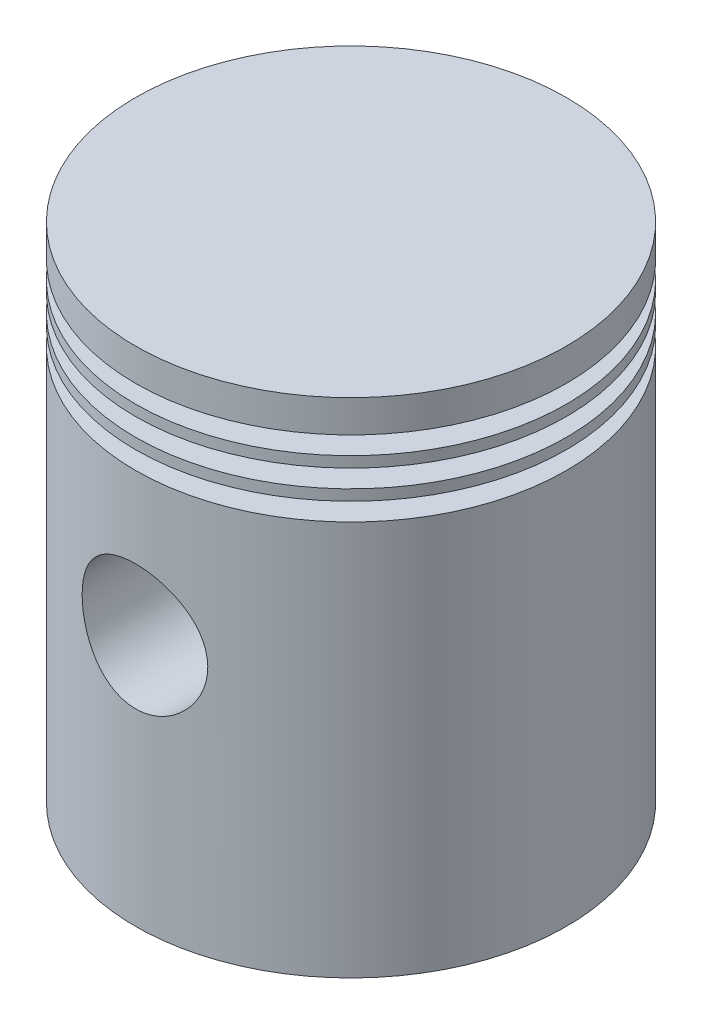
from build123d import *
from build123d.topology import SkipClean

# Parameters (mm, degrees)
MAIN_ANGLE          = 180
CIRCULAR_BOSS_REACH = 111.487
SKETCH6_R           = 11.1125
CIRCULAR_CUT_DEPTH  = 110.4866698
SKETCH7_W           = 4.7625
SKETCH7_H           = 3.175
LPATTERN1_COUNT     = 3
LPATTERN1_PITCH     = 5.08


with BuildPart() as part:
    # Sketch1 → Main (revolve)
    with BuildSketch(Plane(origin=(0, 0, 0), x_dir=(0, 0, -1), z_dir=(1, 0, 0))):
        Polygon((38.1, 88.9), (0, 88.9), (0, 84.1375), (28.575, 84.1375), (28.575, 44.45), (34.925, 44.45), (34.925, 4.7625), (33.3375, 4.7625), (33.3375, 0), (38.1, 0), align=None)
    revolve(axis=Axis((0, 88.9, 0), (0, 1, 0)), revolution_arc=MAIN_ANGLE)

    # Sketch5 → Circular Boss (add, up to next)
    with BuildSketch(Plane.XY.offset(13.208), mode=Mode.PRIVATE) as circular_boss_sk1:
        with BuildLine():
            Line((0, 30.1625), (0, 58.7375))
            ThreePointArc((0, 58.7375), (-14.2875, 44.45), (0, 30.1625))
        make_face()
    circular_boss_tool1 = extrude(circular_boss_sk1.sketch, amount=CIRCULAR_BOSS_REACH, mode=Mode.PRIVATE) - part.part
    circular_boss = circular_boss_tool1.solids().sort_by_distance((-6.063803, 44.45, 13.208))[0]
    add(circular_boss)

    # Sketch6 → Circular Cut (cut, through all)
    with BuildSketch(Plane.XY.offset(13.208)):
        with Locations((0, 44.45)):
            Circle(SKETCH6_R)
    circular_cut = extrude(amount=CIRCULAR_CUT_DEPTH, mode=Mode.SUBTRACT)

    # Sketch7 → Cut-Revolve1 (revolve, cut)
    with BuildSketch(Plane(origin=(0, 7.447290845, 55.242674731), x_dir=(0, 0, -1), z_dir=(1, 0, 0))):
        with Locations((90.961424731, 63.990209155)):
            Rectangle(SKETCH7_W, SKETCH7_H)
    cut_revolve1 = revolve(axis=Axis((0, 73.025, 0), (0, -1, 0)), mode=Mode.SUBTRACT)

    # LPattern1: Cut-Revolve1 ×3
    with Locations(*[(0, i * LPATTERN1_PITCH, 0) for i in range(1, LPATTERN1_COUNT)]):
        add(cut_revolve1, mode=Mode.SUBTRACT)

    # Mirror1: Circular Boss, Circular Cut across plane
    add(circular_boss.mirror(Plane.XY))
    add(circular_cut.mirror(Plane.XY), mode=Mode.SUBTRACT)

    # Mirror2: part across face


with BuildPart() as part_1:
    with SkipClean():  # the faces are left unmerged after this step: merging them gives an invalid solid
        add(part.part)
        add(part.part.mirror(Plane(origin=(0, 74.450038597, 0), x_dir=(0, 0, 1), z_dir=(1, 0, 0))))


solid = part_1.part
